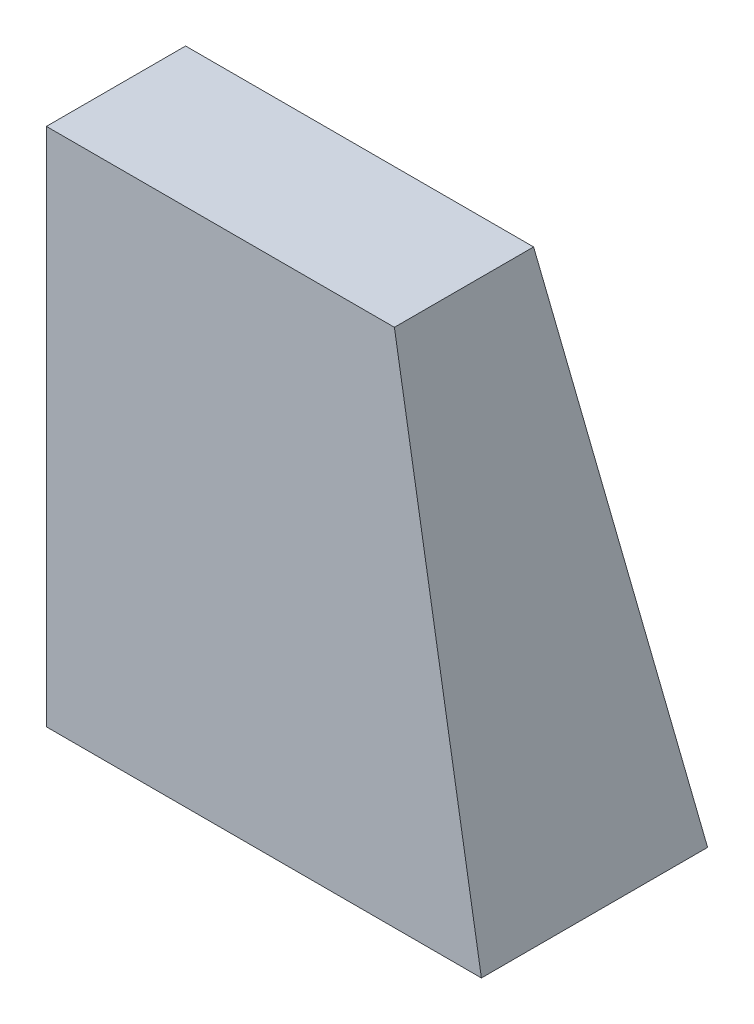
ISO-10303-21;
HEADER;
FILE_DESCRIPTION(('STEP AP214'),'2;1');
FILE_NAME('part.step','',(''),(''),'','','');
FILE_SCHEMA(('AUTOMOTIVE_DESIGN { 1 0 10303 214 1 1 1 1 }'));
ENDSEC;
DATA;
#1=APPLICATION_CONTEXT('core data for automotive mechanical design processes');
#2=APPLICATION_PROTOCOL_DEFINITION('international standard','automotive_design',2000,#1);
#3=PRODUCT_CONTEXT('',#1,'mechanical');
#4=PRODUCT('Part','Part','',(#3));
#5=PRODUCT_RELATED_PRODUCT_CATEGORY('part','',(#4));
#6=PRODUCT_DEFINITION_FORMATION('','',#4);
#7=PRODUCT_DEFINITION_CONTEXT('part definition',#1,'design');
#8=PRODUCT_DEFINITION('design','',#6,#7);
#9=PRODUCT_DEFINITION_SHAPE('','',#8);
#10=(LENGTH_UNIT() NAMED_UNIT(*) SI_UNIT(.MILLI.,.METRE.));
#11=(NAMED_UNIT(*) PLANE_ANGLE_UNIT() SI_UNIT($,.RADIAN.));
#12=(NAMED_UNIT(*) SI_UNIT($,.STERADIAN.) SOLID_ANGLE_UNIT());
#13=UNCERTAINTY_MEASURE_WITH_UNIT(LENGTH_MEASURE(1.E-05),#10,'distance_accuracy_value','');
#14=(GEOMETRIC_REPRESENTATION_CONTEXT(3) GLOBAL_UNCERTAINTY_ASSIGNED_CONTEXT((#13)) GLOBAL_UNIT_ASSIGNED_CONTEXT((#10,
#11,#12)) REPRESENTATION_CONTEXT('',''));
#15=CARTESIAN_POINT('',(0.,0.,0.));
#16=DIRECTION('',(0.,0.,1.));
#17=DIRECTION('',(1.,0.,0.));
#18=AXIS2_PLACEMENT_3D('',#15,#16,#17);
#19=CARTESIAN_POINT('',(0.,151.819924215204,0.));
#20=DIRECTION('',(0.,-1.,0.));
#21=DIRECTION('',(0.,0.,-1.));
#22=AXIS2_PLACEMENT_3D('',#19,#20,#21);
#23=PLANE('',#22);
#24=DIRECTION('',(0.,0.,1.));
#25=VECTOR('',#24,1.);
#26=CARTESIAN_POINT('',(0.,151.819924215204,0.));
#27=LINE('',#26,#25);
#28=CARTESIAN_POINT('',(0.,151.819924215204,-40.64));
#29=VERTEX_POINT('',#28);
#30=CARTESIAN_POINT('',(0.,151.819924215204,0.));
#31=VERTEX_POINT('',#30);
#32=EDGE_CURVE('E91',#29,#31,#27,.T.);
#33=ORIENTED_EDGE('',*,*,#32,.T.);
#34=DIRECTION('',(1.,0.,0.));
#35=VECTOR('',#34,1.);
#36=CARTESIAN_POINT('',(0.,151.819924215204,0.));
#37=LINE('',#36,#35);
#38=CARTESIAN_POINT('',(101.6,151.819924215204,0.));
#39=VERTEX_POINT('',#38);
#40=EDGE_CURVE('E98',#31,#39,#37,.T.);
#41=ORIENTED_EDGE('',*,*,#40,.T.);
#42=DIRECTION('',(0.,0.,-1.));
#43=VECTOR('',#42,1.);
#44=CARTESIAN_POINT('',(101.6,151.819924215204,0.));
#45=LINE('',#44,#43);
#46=CARTESIAN_POINT('',(101.6,151.819924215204,-40.64));
#47=VERTEX_POINT('',#46);
#48=EDGE_CURVE('E104',#39,#47,#45,.T.);
#49=ORIENTED_EDGE('',*,*,#48,.T.);
#50=DIRECTION('',(-1.,0.,0.));
#51=VECTOR('',#50,1.);
#52=CARTESIAN_POINT('',(0.,151.819924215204,-40.64));
#53=LINE('',#52,#51);
#54=EDGE_CURVE('E109',#47,#29,#53,.T.);
#55=ORIENTED_EDGE('',*,*,#54,.T.);
#56=EDGE_LOOP('',(#33,#41,#49,#55));
#57=FACE_BOUND('',#56,.T.);
#58=ADVANCED_FACE('F39',(#57),#23,.F.);
#59=CARTESIAN_POINT('',(0.,0.,-66.04));
#60=DIRECTION('',(0.,-1.,0.));
#61=DIRECTION('',(0.,0.,-1.));
#62=AXIS2_PLACEMENT_3D('',#59,#60,#61);
#63=PLANE('',#62);
#64=DIRECTION('',(0.,0.,1.));
#65=VECTOR('',#64,1.);
#66=CARTESIAN_POINT('',(0.,0.,0.));
#67=LINE('',#66,#65);
#68=CARTESIAN_POINT('',(0.,0.,-66.04));
#69=VERTEX_POINT('',#68);
#70=CARTESIAN_POINT('',(0.,0.,0.));
#71=VERTEX_POINT('',#70);
#72=EDGE_CURVE('E94',#69,#71,#67,.T.);
#73=ORIENTED_EDGE('',*,*,#72,.F.);
#74=DIRECTION('',(-1.,0.,0.));
#75=VECTOR('',#74,1.);
#76=CARTESIAN_POINT('',(0.,0.,-66.04));
#77=LINE('',#76,#75);
#78=CARTESIAN_POINT('',(127.,0.,-66.04));
#79=VERTEX_POINT('',#78);
#80=EDGE_CURVE('E143',#79,#69,#77,.T.);
#81=ORIENTED_EDGE('',*,*,#80,.F.);
#82=DIRECTION('',(0.,0.,-1.));
#83=VECTOR('',#82,1.);
#84=CARTESIAN_POINT('',(127.,0.,0.));
#85=LINE('',#84,#83);
#86=CARTESIAN_POINT('',(127.,0.,0.));
#87=VERTEX_POINT('',#86);
#88=EDGE_CURVE('E51',#87,#79,#85,.T.);
#89=ORIENTED_EDGE('',*,*,#88,.F.);
#90=DIRECTION('',(1.,0.,0.));
#91=VECTOR('',#90,1.);
#92=CARTESIAN_POINT('',(0.,0.,0.));
#93=LINE('',#92,#91);
#94=EDGE_CURVE('E12',#71,#87,#93,.T.);
#95=ORIENTED_EDGE('',*,*,#94,.F.);
#96=EDGE_LOOP('',(#73,#81,#89,#95));
#97=FACE_BOUND('',#96,.T.);
#98=ADVANCED_FACE('F41',(#97),#63,.T.);
#99=CARTESIAN_POINT('',(101.6,151.819924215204,0.));
#100=DIRECTION('',(0.,0.,-1.));
#101=DIRECTION('',(-1.,0.,0.));
#102=AXIS2_PLACEMENT_3D('',#99,#100,#101);
#103=PLANE('',#102);
#104=DIRECTION('',(-0.165010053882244,0.986291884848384,0.));
#105=VECTOR('',#104,1.);
#106=CARTESIAN_POINT('',(127.,0.,0.));
#107=LINE('',#106,#105);
#108=EDGE_CURVE('E59',#87,#39,#107,.T.);
#109=ORIENTED_EDGE('',*,*,#108,.T.);
#110=ORIENTED_EDGE('',*,*,#40,.F.);
#111=DIRECTION('',(0.,1.,0.));
#112=VECTOR('',#111,1.);
#113=CARTESIAN_POINT('',(0.,0.,0.));
#114=LINE('',#113,#112);
#115=EDGE_CURVE('E86',#71,#31,#114,.T.);
#116=ORIENTED_EDGE('',*,*,#115,.F.);
#117=ORIENTED_EDGE('',*,*,#94,.T.);
#118=EDGE_LOOP('',(#109,#110,#116,#117));
#119=FACE_BOUND('',#118,.T.);
#120=ADVANCED_FACE('F100',(#119),#103,.F.);
#121=CARTESIAN_POINT('',(0.,151.819924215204,0.));
#122=DIRECTION('',(1.,0.,0.));
#123=DIRECTION('',(0.,0.,-1.));
#124=AXIS2_PLACEMENT_3D('',#121,#122,#123);
#125=PLANE('',#124);
#126=ORIENTED_EDGE('',*,*,#115,.T.);
#127=ORIENTED_EDGE('',*,*,#32,.F.);
#128=DIRECTION('',(0.,0.986291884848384,0.165010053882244));
#129=VECTOR('',#128,1.);
#130=CARTESIAN_POINT('',(0.,0.,-66.04));
#131=LINE('',#130,#129);
#132=EDGE_CURVE('E103',#69,#29,#131,.T.);
#133=ORIENTED_EDGE('',*,*,#132,.F.);
#134=ORIENTED_EDGE('',*,*,#72,.T.);
#135=EDGE_LOOP('',(#126,#127,#133,#134));
#136=FACE_BOUND('',#135,.T.);
#137=ADVANCED_FACE('F88',(#136),#125,.F.);
#138=CARTESIAN_POINT('',(101.6,151.819924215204,-40.64));
#139=DIRECTION('',(-0.986291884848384,-0.165010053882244,0.));
#140=DIRECTION('',(0.165010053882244,-0.986291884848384,0.));
#141=AXIS2_PLACEMENT_3D('',#138,#139,#140);
#142=PLANE('',#141);
#143=DIRECTION('',(-0.162808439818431,0.973132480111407,0.162808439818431));
#144=VECTOR('',#143,1.);
#145=CARTESIAN_POINT('',(127.,0.,-66.04));
#146=LINE('',#145,#144);
#147=EDGE_CURVE('E159',#79,#47,#146,.T.);
#148=ORIENTED_EDGE('',*,*,#147,.T.);
#149=ORIENTED_EDGE('',*,*,#48,.F.);
#150=ORIENTED_EDGE('',*,*,#108,.F.);
#151=ORIENTED_EDGE('',*,*,#88,.T.);
#152=EDGE_LOOP('',(#148,#149,#150,#151));
#153=FACE_BOUND('',#152,.T.);
#154=ADVANCED_FACE('F180',(#153),#142,.F.);
#155=CARTESIAN_POINT('',(0.,0.,-66.04));
#156=DIRECTION('',(0.,-0.165010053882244,0.986291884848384));
#157=DIRECTION('',(0.,-0.986291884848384,-0.165010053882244));
#158=AXIS2_PLACEMENT_3D('',#155,#156,#157);
#159=PLANE('',#158);
#160=ORIENTED_EDGE('',*,*,#132,.T.);
#161=ORIENTED_EDGE('',*,*,#54,.F.);
#162=ORIENTED_EDGE('',*,*,#147,.F.);
#163=ORIENTED_EDGE('',*,*,#80,.T.);
#164=EDGE_LOOP('',(#160,#161,#162,#163));
#165=FACE_BOUND('',#164,.T.);
#166=ADVANCED_FACE('F157',(#165),#159,.F.);
#167=CLOSED_SHELL('',(#58,#98,#120,#137,#154,#166));
#168=MANIFOLD_SOLID_BREP('B2',#167);
#169=ADVANCED_BREP_SHAPE_REPRESENTATION('',(#18,#168),#14);
#170=SHAPE_DEFINITION_REPRESENTATION(#9,#169);
ENDSEC;
END-ISO-10303-21;
